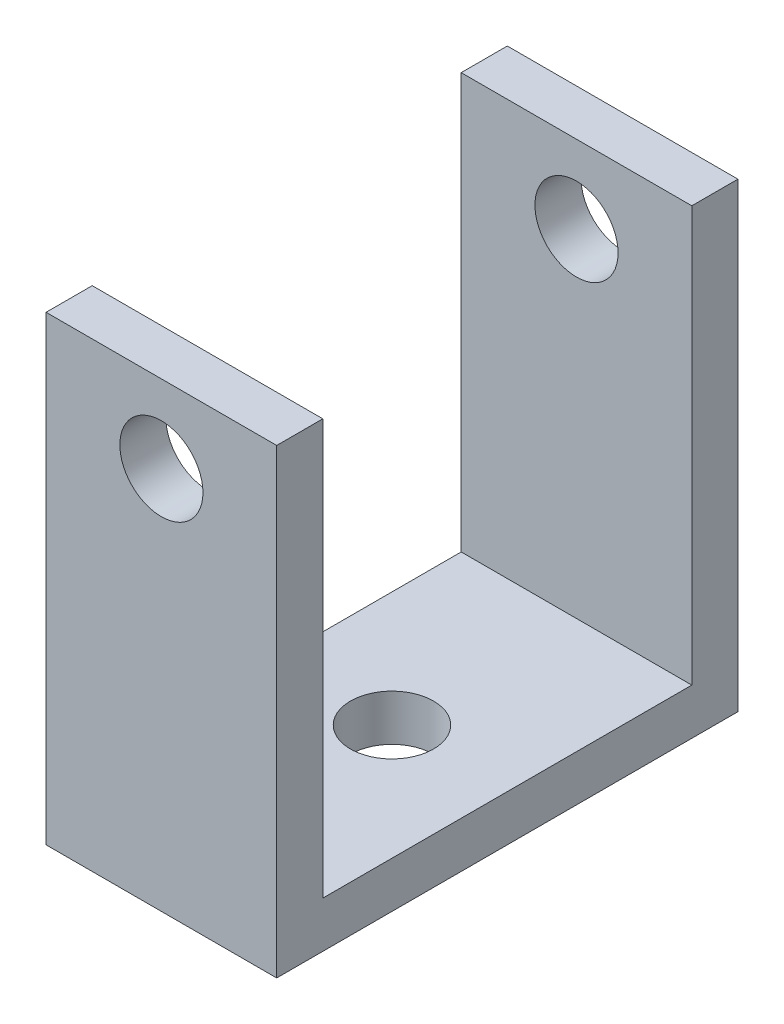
from build123d import *

# Parameters (mm, degrees)
EXTRUDE_THIN1_DEPTH = 6.35
EXTRUDE1_DEPTH      = 30.099355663
EXTRUDE1_DEPTH_BACK = 30.099355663
SKETCH2_R           = 2.289180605
SKETCH3_R           = 2.289180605
EXTRUDE2_DEPTH      = 30.099355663


with BuildPart() as part:
    # Sketch1 → Extrude-Thin1 (new, symmetric)
    with BuildSketch(Plane(origin=(0, 0, 0), x_dir=(0, 0, -1), z_dir=(1, 0, 0))):
        Polygon((-12.7, 25.4), (-12.7, 0), (12.7, 0), (12.7, 25.4), (10.16, 25.4), (10.16, 2.54), (-10.16, 2.54), (-10.16, 25.4), align=None)
    extrude(amount=EXTRUDE_THIN1_DEPTH, both=True)

    # Sketch2 → Extrude1 (cut, two sides: drawn at the far end of the back side and taken through both)
    with BuildSketch(Plane.XY.offset(-EXTRUDE1_DEPTH_BACK)):
        with Locations((0, 21.114069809)):
            Circle(SKETCH2_R)
    extrude(amount=EXTRUDE1_DEPTH + EXTRUDE1_DEPTH_BACK, mode=Mode.SUBTRACT)

    # Sketch3 → Extrude2 (cut, through all)
    with BuildSketch(Plane.XZ):
        with Locations(Location((0, 0, 0), (0, 0, 270))):
            Circle(SKETCH3_R)
    extrude(amount=-EXTRUDE2_DEPTH, mode=Mode.SUBTRACT)


solid = part.part
